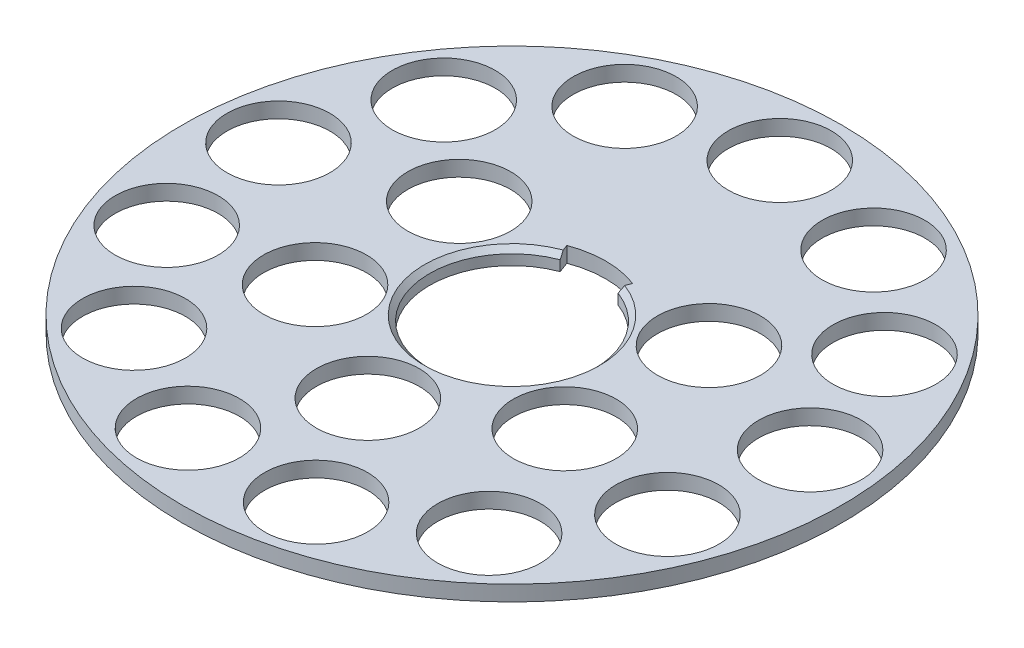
from build123d import *

# Parameters (mm, degrees)
SKETCH1_R           = 32
BOSS_EXTRUDE1_DEPTH = 1.5
CHAMFER1_SIZE       = 0.5
SKETCH2_R           = 5
CUT_EXTRUDE1_DEPTH  = 46.279686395


with BuildPart() as part:
    # Sketch1 → Boss-Extrude1 (new body)
    with BuildSketch(Plane(origin=(0, 0, 0), x_dir=(1, 0, 0), z_dir=(0, 1, 0))):
        with Locations(Location((0, 0, 0), (0, 0, 270))):
            Circle(SKETCH1_R)
        with BuildLine():
            Line((2.808987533, 7.490633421), (3, 8))
            Line((3, 8), (3.195223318, 8.520595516))
            ThreePointArc((3.195223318, 8.520595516), (0, 9.1), (-3.195223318, 8.520595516))
            Line((-3.195223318, 8.520595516), (-3, 8))
            Line((-3, 8), (-2.808987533, 7.490633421))
            ThreePointArc((-2.808987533, 7.490633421), (0, -8), (2.808987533, 7.490633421))
        make_face(mode=Mode.SUBTRACT)
    extrude(amount=-BOSS_EXTRUDE1_DEPTH)

    # Chamfer1
    chamfer1_edges = [part.edges().sort_by_distance(p)[0] for p in [
        (0, 0, 8),
    ]]
    chamfer(chamfer1_edges, length=CHAMFER1_SIZE)

    # Sketch2 → Cut-Extrude1 (cut, through all)
    with BuildSketch(Plane(origin=(0, 0, 0), x_dir=(1, 0, 0), z_dir=(0, 1, 0))):
        with Locations(Location((0, 26, 0), (0, 0, 270))):
            Circle(SKETCH2_R)
        with Locations(Location((12.082802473, 23.021856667, 0), (0, 0, 270))):
            Circle(SKETCH2_R)
        with Locations(Location((21.397580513, 14.769683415, 0), (0, 0, 270))):
            Circle(SKETCH2_R)
        with Locations(Location((25.810430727, 3.133953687, 0), (0, 0, 270))):
            Circle(SKETCH2_R)
        with Locations(Location((24.31042231, -9.219727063, 0), (0, 0, 270))):
            Circle(SKETCH2_R)
        with Locations(Location((17.241189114, -19.461279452, 0), (0, 0, 270))):
            Circle(SKETCH2_R)
        with Locations(Location((6.222207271, -25.244487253, 0), (0, 0, 270))):
            Circle(SKETCH2_R)
        with Locations(Location((-6.222207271, -25.244487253, 0), (0, 0, 270))):
            Circle(SKETCH2_R)
        with Locations(Location((-17.241189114, -19.461279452, 0), (0, 0, 270))):
            Circle(SKETCH2_R)
        with Locations(Location((-24.31042231, -9.219727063, 0), (0, 0, 270))):
            Circle(SKETCH2_R)
        with Locations(Location((-25.810430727, 3.133953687, 0), (0, 0, 270))):
            Circle(SKETCH2_R)
        with Locations(Location((-21.397580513, 14.769683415, 0), (0, 0, 270))):
            Circle(SKETCH2_R)
        with Locations(Location((-12.082802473, 23.021856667, 0), (0, 0, 270))):
            Circle(SKETCH2_R)
        with Locations(Location((12.124355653, 7, 0), (0, 0, 270))):
            Circle(SKETCH2_R)
        with Locations(Location((12.124355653, -7, 0), (0, 0, 270))):
            Circle(SKETCH2_R)
        with Locations(Location((0, -14, 0), (0, 0, 270))):
            Circle(SKETCH2_R)
        with Locations(Location((-12.124355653, -7, 0), (0, 0, 270))):
            Circle(SKETCH2_R)
        with Locations(Location((-12.124355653, 7, 0), (0, 0, 270))):
            Circle(SKETCH2_R)
    extrude(amount=-CUT_EXTRUDE1_DEPTH, mode=Mode.SUBTRACT)


solid = part.part
